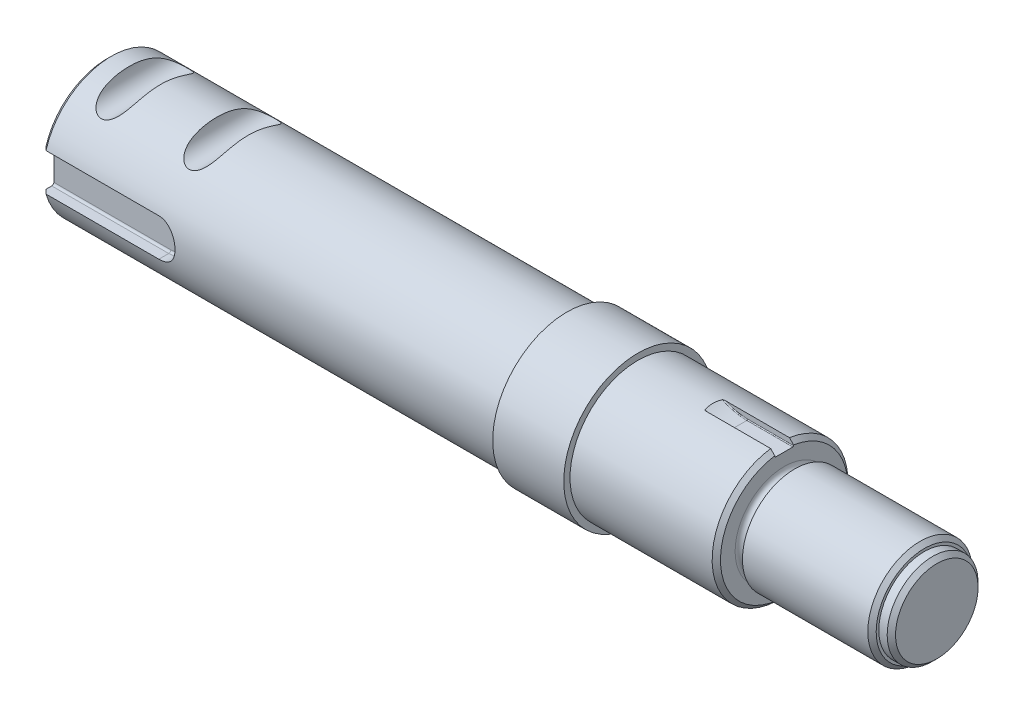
from build123d import *

# Parameters (mm, degrees)
CHANFREIN1_SIZE  = 2
CHANFREIN2_SIZE  = 2
ESQUISSE5_R      = 7.5
EXTRUSION3_DEPTH = 76
EXTRUSION4_DEPTH = 7
EXTRUSION5_DEPTH = 4.5
CONG_2_R         = 1
CONG_3_R         = 0.4
ESQUISSE8_W      = 34
ESQUISSE8_H      = 3


with BuildPart() as part:
    # Esquisse4 → R_volution1 (revolve)
    with BuildSketch(Plane.XY, mode=Mode.PRIVATE) as r_volution1_sk:
        with BuildLine():
            Line((0, 32.5), (0, 0))
            Line((0, 0), (397, 0))
            Line((397, 0), (397, 21.75))
            Line((397, 21.75), (391, 21.75))
            Line((391, 21.75), (391, 25))
            Line((391, 25), (329, 25))
            Line((329, 25), (329, 23.5))
            ThreePointArc((329, 23.5), (326.5, 21), (324, 23.5))
            Line((324, 23.5), (324, 30.5))
            Line((324, 30.5), (322, 32.5))
            Line((322, 32.5), (0, 32.5))
        make_face()
    revolve(r_volution1_sk.sketch.rotate(Axis((0, 0, 0), (1, 0, 0)), 90), axis=Axis((0, 0, 0), (1, 0, 0)))

    # Chanfrein1
    chanfrein1_edges = [part.edges().sort_by_distance(p)[0] for p in [
        (397, 0, -21.75),
        (391, 0, -25),
    ]]
    chamfer(chanfrein1_edges, length=CHANFREIN1_SIZE)

    # Chanfrein2
    chanfrein2_edges = [part.edges().sort_by_distance(p)[0] for p in [
        (0, 0, -32.5),
    ]]
    chamfer(chanfrein2_edges, length=CHANFREIN2_SIZE)

    # Esquisse5 → Extrusion3 (cut, symmetric)
    with BuildSketch(Plane.XY):
        with Locations((18, 32.5)):
            Circle(ESQUISSE5_R)
        with Locations((60, 32.5)):
            Circle(ESQUISSE5_R)
        with Locations((18, -32.5)):
            Circle(ESQUISSE5_R)
        with Locations((60, -32.5)):
            Circle(ESQUISSE5_R)
    extrude(amount=EXTRUSION3_DEPTH, both=True, mode=Mode.SUBTRACT)

    # Esquisse6 → Extrusion4 (cut)
    with BuildSketch(Plane.XY.offset(32.5)):
        with BuildLine():
            Line((0, 9), (56, 9))
            ThreePointArc((56, 9), (65, 0), (56, -9))
            Line((56, -9), (0, -9))
            Line((0, -9), (0, 9))
        make_face()
    extrude(amount=-EXTRUSION4_DEPTH, mode=Mode.SUBTRACT)

    # Esquisse7 → Extrusion5 (cut, symmetric)
    with BuildSketch(Plane.XY):
        with BuildLine():
            Line((324, 29.5), (302, 29.5))
            ThreePointArc((302, 29.5), (286.126690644, 34.780008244), (276.578755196, 48.515996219))
            Line((276.578755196, 48.515996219), (324, 48.515996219))
            Line((324, 48.515996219), (324, 29.5))
        make_face()
    extrude(amount=EXTRUSION5_DEPTH, both=True, mode=Mode.SUBTRACT)

    # Cong_2
    cong_2_edges = [part.edges().sort_by_distance(p)[0] for p in [
        (65, 0, 25.5),
        (28, 9, 25.5),
        (28, -9, 25.5),
    ]]
    fillet(cong_2_edges, radius=CONG_2_R)

    # Cong_3
    cong_3_edges = [part.edges().sort_by_distance(p)[0] for p in [
        (296.033247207, 30.180475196, 4.5),
        (296.033247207, 30.180475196, -4.5),
        (313, 29.5, 4.5),
        (313, 29.5, -4.5),
    ]]
    fillet(cong_3_edges, radius=CONG_3_R)

    # Esquisse8 → R_volution2 (revolve)
    with BuildSketch(Plane.XY, mode=Mode.PRIVATE) as r_volution2_sk:
        with Locations((237, 34)):
            Rectangle(ESQUISSE8_W, ESQUISSE8_H)
    revolve(r_volution2_sk.sketch.rotate(Axis((0, 0, 0), (-1, 0, 0)), 352.041168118), axis=Axis((0, 0, 0), (-1, 0, 0)))


solid = part.part
